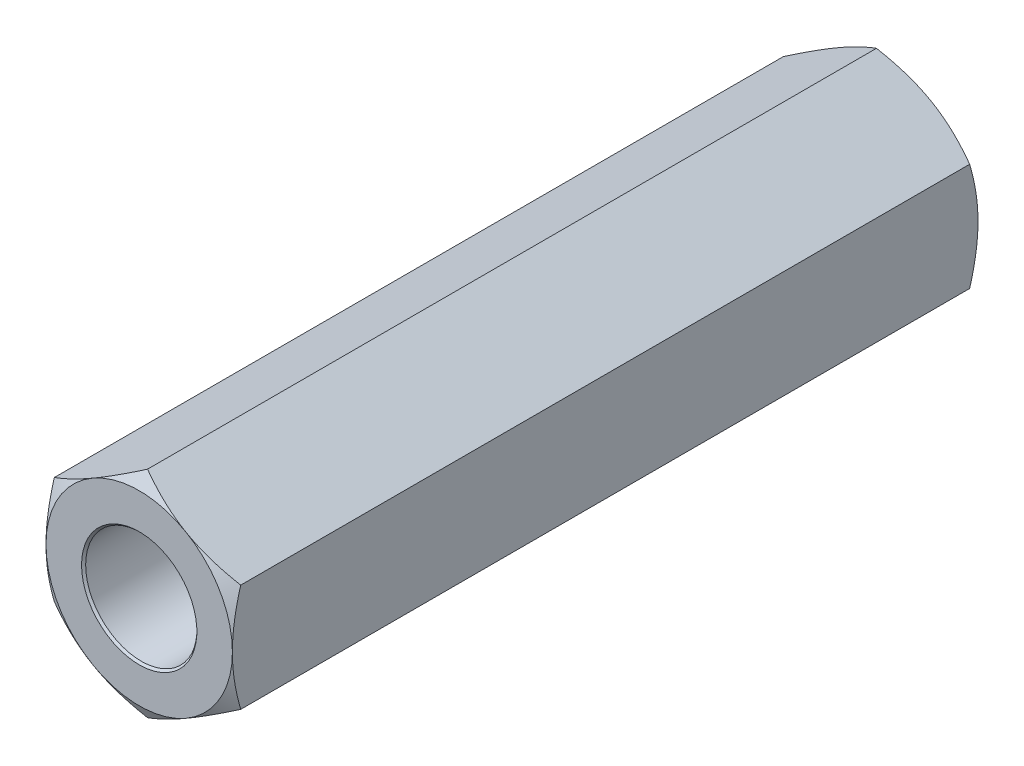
ISO-10303-21;
HEADER;
FILE_DESCRIPTION(('STEP AP214'),'2;1');
FILE_NAME('part.step','',(''),(''),'','','');
FILE_SCHEMA(('AUTOMOTIVE_DESIGN { 1 0 10303 214 1 1 1 1 }'));
ENDSEC;
DATA;
#1=APPLICATION_CONTEXT('core data for automotive mechanical design processes');
#2=APPLICATION_PROTOCOL_DEFINITION('international standard','automotive_design',2000,#1);
#3=PRODUCT_CONTEXT('',#1,'mechanical');
#4=PRODUCT('Part','Part','',(#3));
#5=PRODUCT_RELATED_PRODUCT_CATEGORY('part','',(#4));
#6=PRODUCT_DEFINITION_FORMATION('','',#4);
#7=PRODUCT_DEFINITION_CONTEXT('part definition',#1,'design');
#8=PRODUCT_DEFINITION('design','',#6,#7);
#9=PRODUCT_DEFINITION_SHAPE('','',#8);
#10=(LENGTH_UNIT() NAMED_UNIT(*) SI_UNIT(.MILLI.,.METRE.));
#11=(NAMED_UNIT(*) PLANE_ANGLE_UNIT() SI_UNIT($,.RADIAN.));
#12=(NAMED_UNIT(*) SI_UNIT($,.STERADIAN.) SOLID_ANGLE_UNIT());
#13=UNCERTAINTY_MEASURE_WITH_UNIT(LENGTH_MEASURE(1.E-05),#10,'distance_accuracy_value','');
#14=(GEOMETRIC_REPRESENTATION_CONTEXT(3) GLOBAL_UNCERTAINTY_ASSIGNED_CONTEXT((#13)) GLOBAL_UNIT_ASSIGNED_CONTEXT((#10,
#11,#12)) REPRESENTATION_CONTEXT('',''));
#15=CARTESIAN_POINT('',(0.,0.,0.));
#16=DIRECTION('',(0.,0.,1.));
#17=DIRECTION('',(1.,0.,0.));
#18=AXIS2_PLACEMENT_3D('',#15,#16,#17);
#19=CARTESIAN_POINT('',(0.,2.74963065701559,9.525));
#20=DIRECTION('',(0.,0.,1.));
#21=DIRECTION('',(1.,0.,0.));
#22=AXIS2_PLACEMENT_3D('',#19,#20,#21);
#23=PLANE('',#22);
#24=CARTESIAN_POINT('',(0.,0.,9.525));
#25=DIRECTION('',(0.,0.,-1.));
#26=DIRECTION('',(-1.,0.,0.));
#27=AXIS2_PLACEMENT_3D('',#24,#25,#26);
#28=CIRCLE('',#27,2.38125);
#29=CARTESIAN_POINT('',(2.38125,0.,9.525));
#30=VERTEX_POINT('',#29);
#31=CARTESIAN_POINT('',(1.190625,-2.06222299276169,9.525));
#32=VERTEX_POINT('',#31);
#33=EDGE_CURVE('E145',#30,#32,#28,.T.);
#34=ORIENTED_EDGE('',*,*,#33,.F.);
#35=CARTESIAN_POINT('',(1.190625,2.0622229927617,9.525));
#36=VERTEX_POINT('',#35);
#37=EDGE_CURVE('E135',#36,#30,#28,.T.);
#38=ORIENTED_EDGE('',*,*,#37,.F.);
#39=CARTESIAN_POINT('',(-1.190625,2.0622229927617,9.525));
#40=VERTEX_POINT('',#39);
#41=EDGE_CURVE('E144',#40,#36,#28,.T.);
#42=ORIENTED_EDGE('',*,*,#41,.F.);
#43=CARTESIAN_POINT('',(-2.38125,0.,9.525));
#44=VERTEX_POINT('',#43);
#45=EDGE_CURVE('E60',#44,#40,#28,.T.);
#46=ORIENTED_EDGE('',*,*,#45,.F.);
#47=CARTESIAN_POINT('',(-1.190625,-2.0622229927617,9.525));
#48=VERTEX_POINT('',#47);
#49=EDGE_CURVE('E68',#48,#44,#28,.T.);
#50=ORIENTED_EDGE('',*,*,#49,.F.);
#51=EDGE_CURVE('E162',#32,#48,#28,.T.);
#52=ORIENTED_EDGE('',*,*,#51,.F.);
#53=EDGE_LOOP('',(#34,#38,#42,#46,#50,#52));
#54=FACE_BOUND('',#53,.T.);
#55=CARTESIAN_POINT('',(0.,0.,9.525));
#56=DIRECTION('',(0.,0.,-1.));
#57=DIRECTION('',(-1.,0.,0.));
#58=AXIS2_PLACEMENT_3D('',#55,#56,#57);
#59=CIRCLE('',#58,1.4732);
#60=CARTESIAN_POINT('',(-1.4732,0.,9.525));
#61=VERTEX_POINT('',#60);
#62=EDGE_CURVE('E331',#61,#61,#59,.T.);
#63=ORIENTED_EDGE('',*,*,#62,.T.);
#64=EDGE_LOOP('',(#63));
#65=FACE_BOUND('',#64,.T.);
#66=ADVANCED_FACE('F38',(#54,#65),#23,.T.);
#67=CARTESIAN_POINT('',(0.,0.,9.525));
#68=DIRECTION('',(0.,0.,-1.));
#69=DIRECTION('',(-1.,0.,0.));
#70=AXIS2_PLACEMENT_3D('',#67,#68,#69);
#71=CYLINDRICAL_SURFACE('',#70,1.4224);
#72=CARTESIAN_POINT('',(0.,0.,-9.47052366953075));
#73=DIRECTION('',(0.,0.,-1.));
#74=DIRECTION('',(-1.,0.,0.));
#75=AXIS2_PLACEMENT_3D('',#72,#73,#74);
#76=CIRCLE('',#75,1.4224);
#77=CARTESIAN_POINT('',(-1.4224,0.,-9.47052366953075));
#78=VERTEX_POINT('',#77);
#79=EDGE_CURVE('E314',#78,#78,#76,.F.);
#80=CARTESIAN_POINT('',(0.,0.,9.47052366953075));
#81=DIRECTION('',(0.,0.,1.));
#82=DIRECTION('',(1.,0.,0.));
#83=AXIS2_PLACEMENT_3D('',#80,#81,#82);
#84=CIRCLE('',#83,1.4224);
#85=CARTESIAN_POINT('',(-1.4224,0.,9.47052366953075));
#86=VERTEX_POINT('',#85);
#87=EDGE_CURVE('E329',#86,#86,#84,.T.);
#88=CARTESIAN_POINT('',(-1.4224,0.,-9.47052366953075));
#89=CARTESIAN_POINT('',(-1.4224,0.,-9.27322109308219));
#90=CARTESIAN_POINT('',(-1.4224,0.,-9.07591851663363));
#91=CARTESIAN_POINT('',(-1.4224,0.,-8.68131336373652));
#92=CARTESIAN_POINT('',(-1.4224,0.,-8.48401078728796));
#93=CARTESIAN_POINT('',(-1.4224,0.,-8.08940563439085));
#94=CARTESIAN_POINT('',(-1.4224,0.,-7.89210305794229));
#95=CARTESIAN_POINT('',(-1.4224,0.,-7.49749790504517));
#96=CARTESIAN_POINT('',(-1.4224,0.,-7.30019532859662));
#97=CARTESIAN_POINT('',(-1.4224,0.,-6.9055901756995));
#98=CARTESIAN_POINT('',(-1.4224,0.,-6.70828759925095));
#99=CARTESIAN_POINT('',(-1.4224,0.,-6.31368244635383));
#100=CARTESIAN_POINT('',(-1.4224,0.,-6.11637986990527));
#101=CARTESIAN_POINT('',(-1.4224,0.,-5.72177471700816));
#102=CARTESIAN_POINT('',(-1.4224,0.,-5.5244721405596));
#103=CARTESIAN_POINT('',(-1.4224,0.,-5.12986698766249));
#104=CARTESIAN_POINT('',(-1.4224,0.,-4.93256441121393));
#105=CARTESIAN_POINT('',(-1.4224,0.,-4.53795925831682));
#106=CARTESIAN_POINT('',(-1.4224,0.,-4.34065668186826));
#107=CARTESIAN_POINT('',(-1.4224,0.,-3.94605152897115));
#108=CARTESIAN_POINT('',(-1.4224,0.,-3.74874895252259));
#109=CARTESIAN_POINT('',(-1.4224,0.,-3.35414379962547));
#110=CARTESIAN_POINT('',(-1.4224,0.,-3.15684122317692));
#111=CARTESIAN_POINT('',(-1.4224,0.,-2.7622360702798));
#112=CARTESIAN_POINT('',(-1.4224,0.,-2.56493349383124));
#113=CARTESIAN_POINT('',(-1.4224,0.,-2.17032834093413));
#114=CARTESIAN_POINT('',(-1.4224,0.,-1.97302576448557));
#115=CARTESIAN_POINT('',(-1.4224,0.,-1.57842061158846));
#116=CARTESIAN_POINT('',(-1.4224,0.,-1.3811180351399));
#117=CARTESIAN_POINT('',(-1.4224,0.,-0.986512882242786));
#118=CARTESIAN_POINT('',(-1.4224,0.,-0.789210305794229));
#119=CARTESIAN_POINT('',(-1.4224,0.,-0.394605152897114));
#120=CARTESIAN_POINT('',(-1.4224,0.,-0.197302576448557));
#121=CARTESIAN_POINT('',(-1.4224,0.,0.197302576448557));
#122=CARTESIAN_POINT('',(-1.4224,0.,0.394605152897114));
#123=CARTESIAN_POINT('',(-1.4224,0.,0.789210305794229));
#124=CARTESIAN_POINT('',(-1.4224,0.,0.986512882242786));
#125=CARTESIAN_POINT('',(-1.4224,0.,1.3811180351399));
#126=CARTESIAN_POINT('',(-1.4224,0.,1.57842061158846));
#127=CARTESIAN_POINT('',(-1.4224,0.,1.97302576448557));
#128=CARTESIAN_POINT('',(-1.4224,0.,2.17032834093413));
#129=CARTESIAN_POINT('',(-1.4224,0.,2.56493349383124));
#130=CARTESIAN_POINT('',(-1.4224,0.,2.7622360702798));
#131=CARTESIAN_POINT('',(-1.4224,0.,3.15684122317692));
#132=CARTESIAN_POINT('',(-1.4224,0.,3.35414379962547));
#133=CARTESIAN_POINT('',(-1.4224,0.,3.74874895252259));
#134=CARTESIAN_POINT('',(-1.4224,0.,3.94605152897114));
#135=CARTESIAN_POINT('',(-1.4224,0.,4.34065668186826));
#136=CARTESIAN_POINT('',(-1.4224,0.,4.53795925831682));
#137=CARTESIAN_POINT('',(-1.4224,0.,4.93256441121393));
#138=CARTESIAN_POINT('',(-1.4224,0.,5.12986698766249));
#139=CARTESIAN_POINT('',(-1.4224,0.,5.5244721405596));
#140=CARTESIAN_POINT('',(-1.4224,0.,5.72177471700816));
#141=CARTESIAN_POINT('',(-1.4224,0.,6.11637986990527));
#142=CARTESIAN_POINT('',(-1.4224,0.,6.31368244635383));
#143=CARTESIAN_POINT('',(-1.4224,0.,6.70828759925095));
#144=CARTESIAN_POINT('',(-1.4224,0.,6.9055901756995));
#145=CARTESIAN_POINT('',(-1.4224,0.,7.30019532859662));
#146=CARTESIAN_POINT('',(-1.4224,0.,7.49749790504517));
#147=CARTESIAN_POINT('',(-1.4224,0.,7.89210305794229));
#148=CARTESIAN_POINT('',(-1.4224,0.,8.08940563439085));
#149=CARTESIAN_POINT('',(-1.4224,0.,8.48401078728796));
#150=CARTESIAN_POINT('',(-1.4224,0.,8.68131336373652));
#151=CARTESIAN_POINT('',(-1.4224,0.,9.07591851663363));
#152=CARTESIAN_POINT('',(-1.4224,0.,9.27322109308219));
#153=CARTESIAN_POINT('',(-1.4224,0.,9.47052366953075));
#154=B_SPLINE_CURVE_WITH_KNOTS('',3,(#88,#89,#90,#91,#92,#93,#94,#95,#96,#97,#98,#99,#100,#101,
#102,#103,#104,#105,#106,#107,#108,#109,#110,#111,#112,#113,#114,#115,#116,#117,#118,#119,#120,
#121,#122,#123,#124,#125,#126,#127,#128,#129,#130,#131,#132,#133,#134,#135,#136,#137,#138,#139,
#140,#141,#142,#143,#144,#145,#146,#147,#148,#149,#150,#151,#152,#153),.UNSPECIFIED.,.F.,.F.,(4,
2,2,2,2,2,2,2,2,2,2,2,2,2,2,2,2,2,2,2,2,2,2,2,2,2,2,2,2,2,2,2,4),(0.,0.591907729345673,
1.18381545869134,1.77572318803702,2.36763091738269,2.95953864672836,3.55144637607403,
4.1433541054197,4.73526183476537,5.32716956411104,5.91907729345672,6.51098502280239,
7.10289275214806,7.69480048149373,8.2867082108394,8.87861594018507,9.47052366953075,
10.0624313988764,10.6543391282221,11.2462468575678,11.8381545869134,12.4300623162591,
13.0219700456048,13.6138777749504,14.2057855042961,14.7976932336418,15.3896009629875,
15.9815086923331,16.5734164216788,17.1653241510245,17.7572318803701,18.3491396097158,
18.9410473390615),.UNSPECIFIED.);
#155=EDGE_CURVE('BSEAM369',#78,#86,#154,.T.);
#156=ORIENTED_EDGE('',*,*,#79,.F.);
#157=ORIENTED_EDGE('',*,*,#87,.T.);
#158=ORIENTED_EDGE('',*,*,#155,.T.);
#159=ORIENTED_EDGE('',*,*,#155,.F.);
#160=EDGE_LOOP('',(#156,#158,#157,#159));
#161=FACE_BOUND('',#160,.T.);
#162=ADVANCED_FACE('F369',(#161),#71,.F.);
#163=CARTESIAN_POINT('',(2.38125,1.3748153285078,9.525));
#164=DIRECTION('',(-0.499999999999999,-0.866025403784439,0.));
#165=DIRECTION('',(0.866025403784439,-0.499999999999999,0.));
#166=AXIS2_PLACEMENT_3D('',#163,#164,#165);
#167=PLANE('',#166);
#168=DIRECTION('',(0.,0.,-1.));
#169=VECTOR('',#168,1.);
#170=CARTESIAN_POINT('',(0.,2.74963065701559,9.525));
#171=LINE('',#170,#169);
#172=CARTESIAN_POINT('',(0.,2.74963065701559,9.3123153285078));
#173=VERTEX_POINT('',#172);
#174=CARTESIAN_POINT('',(0.,2.74963065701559,-9.3123153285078));
#175=VERTEX_POINT('',#174);
#176=EDGE_CURVE('E327',#173,#175,#171,.T.);
#177=ORIENTED_EDGE('',*,*,#176,.F.);
#178=CARTESIAN_POINT('',(-0.000200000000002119,2.74974612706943,9.31224865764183));
#179=CARTESIAN_POINT('',(0.104444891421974,2.68932937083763,9.34714474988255));
#180=CARTESIAN_POINT('',(0.209993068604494,2.62839110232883,9.37888175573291));
#181=CARTESIAN_POINT('',(0.422917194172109,2.5054593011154,9.43427966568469));
#182=CARTESIAN_POINT('',(0.530296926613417,2.4434635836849,9.45792097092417));
#183=CARTESIAN_POINT('',(0.743725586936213,2.32024048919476,9.49472299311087));
#184=CARTESIAN_POINT('',(0.849741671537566,2.25903207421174,9.50812863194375));
#185=CARTESIAN_POINT('',(1.06227281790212,2.13632715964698,9.52413371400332));
#186=CARTESIAN_POINT('',(1.16878710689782,2.07483110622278,9.52674640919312));
#187=CARTESIAN_POINT('',(1.36782399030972,1.95991710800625,9.52131824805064));
#188=CARTESIAN_POINT('',(1.46037634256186,1.90648198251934,9.51461019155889));
#189=CARTESIAN_POINT('',(1.64487805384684,1.79995986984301,9.49334736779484));
#190=CARTESIAN_POINT('',(1.73682677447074,1.74687325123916,9.47878533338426));
#191=CARTESIAN_POINT('',(1.92170905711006,1.64013141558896,9.44238049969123));
#192=CARTESIAN_POINT('',(2.01461921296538,1.58648971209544,9.42038334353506));
#193=CARTESIAN_POINT('',(2.19905359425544,1.4800064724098,9.37045811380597));
#194=CARTESIAN_POINT('',(2.2905801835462,1.42716357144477,9.34254177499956));
#195=CARTESIAN_POINT('',(2.38145,1.37469985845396,9.31224865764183));
#196=B_SPLINE_CURVE_WITH_KNOTS('',3,(#178,#179,#180,#181,#182,#183,#184,#185,#186,#187,#188,
#189,#190,#191,#192,#193,#194,#195),.UNSPECIFIED.,.F.,.F.,(4,2,2,2,2,2,2,2,4),(0.,
0.377463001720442,0.755833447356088,1.12483885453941,1.49339104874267,1.81432726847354,
2.1355609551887,2.46392121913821,2.79163649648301),.UNSPECIFIED.);
#197=EDGE_CURVE('E349',#173,#36,#196,.T.);
#198=ORIENTED_EDGE('',*,*,#197,.T.);
#199=CARTESIAN_POINT('',(2.38125,1.3748153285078,9.3123153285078));
#200=VERTEX_POINT('',#199);
#201=EDGE_CURVE('E139',#36,#200,#196,.T.);
#202=ORIENTED_EDGE('',*,*,#201,.T.);
#203=DIRECTION('',(0.,0.,-1.));
#204=VECTOR('',#203,1.);
#205=CARTESIAN_POINT('',(2.38125,1.3748153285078,9.525));
#206=LINE('',#205,#204);
#207=CARTESIAN_POINT('',(2.38125,1.3748153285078,-9.3123153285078));
#208=VERTEX_POINT('',#207);
#209=EDGE_CURVE('E159',#200,#208,#206,.T.);
#210=ORIENTED_EDGE('',*,*,#209,.T.);
#211=CARTESIAN_POINT('',(-0.000200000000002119,2.74974612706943,-9.31224865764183));
#212=CARTESIAN_POINT('',(0.104444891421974,2.68932937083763,-9.34714474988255));
#213=CARTESIAN_POINT('',(0.209993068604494,2.62839110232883,-9.37888175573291));
#214=CARTESIAN_POINT('',(0.422917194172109,2.5054593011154,-9.43427966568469));
#215=CARTESIAN_POINT('',(0.530296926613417,2.4434635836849,-9.45792097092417));
#216=CARTESIAN_POINT('',(0.743725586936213,2.32024048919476,-9.49472299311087));
#217=CARTESIAN_POINT('',(0.849741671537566,2.25903207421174,-9.50812863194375));
#218=CARTESIAN_POINT('',(1.06227281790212,2.13632715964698,-9.52413371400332));
#219=CARTESIAN_POINT('',(1.16878710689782,2.07483110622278,-9.52674640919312));
#220=CARTESIAN_POINT('',(1.36782399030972,1.95991710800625,-9.52131824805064));
#221=CARTESIAN_POINT('',(1.46037634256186,1.90648198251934,-9.51461019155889));
#222=CARTESIAN_POINT('',(1.64487805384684,1.79995986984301,-9.49334736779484));
#223=CARTESIAN_POINT('',(1.73682677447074,1.74687325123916,-9.47878533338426));
#224=CARTESIAN_POINT('',(1.92170905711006,1.64013141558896,-9.44238049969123));
#225=CARTESIAN_POINT('',(2.01461921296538,1.58648971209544,-9.42038334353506));
#226=CARTESIAN_POINT('',(2.19905359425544,1.4800064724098,-9.37045811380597));
#227=CARTESIAN_POINT('',(2.2905801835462,1.42716357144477,-9.34254177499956));
#228=CARTESIAN_POINT('',(2.38145,1.37469985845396,-9.31224865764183));
#229=B_SPLINE_CURVE_WITH_KNOTS('',3,(#211,#212,#213,#214,#215,#216,#217,#218,#219,#220,#221,
#222,#223,#224,#225,#226,#227,#228),.UNSPECIFIED.,.F.,.F.,(4,2,2,2,2,2,2,2,4),(0.,
0.377463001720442,0.755833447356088,1.12483885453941,1.49339104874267,1.81432726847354,
2.1355609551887,2.46392121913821,2.79163649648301),.UNSPECIFIED.);
#230=CARTESIAN_POINT('',(1.190625,2.0622229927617,-9.525));
#231=VERTEX_POINT('',#230);
#232=EDGE_CURVE('E231',#231,#208,#229,.T.);
#233=ORIENTED_EDGE('',*,*,#232,.F.);
#234=EDGE_CURVE('E283',#175,#231,#229,.T.);
#235=ORIENTED_EDGE('',*,*,#234,.F.);
#236=EDGE_LOOP('',(#177,#198,#202,#210,#233,#235));
#237=FACE_BOUND('',#236,.T.);
#238=ADVANCED_FACE('F40',(#237),#167,.F.);
#239=CARTESIAN_POINT('',(0.,2.74963065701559,9.525));
#240=DIRECTION('',(0.500000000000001,-0.866025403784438,0.));
#241=DIRECTION('',(0.866025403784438,0.500000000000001,0.));
#242=AXIS2_PLACEMENT_3D('',#239,#240,#241);
#243=PLANE('',#242);
#244=DIRECTION('',(0.,0.,-1.));
#245=VECTOR('',#244,1.);
#246=CARTESIAN_POINT('',(-2.38125,1.3748153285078,9.525));
#247=LINE('',#246,#245);
#248=CARTESIAN_POINT('',(-2.38125,1.3748153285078,9.3123153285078));
#249=VERTEX_POINT('',#248);
#250=CARTESIAN_POINT('',(-2.38125,1.3748153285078,-9.3123153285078));
#251=VERTEX_POINT('',#250);
#252=EDGE_CURVE('E325',#249,#251,#247,.T.);
#253=ORIENTED_EDGE('',*,*,#252,.F.);
#254=CARTESIAN_POINT('',(-2.38145,1.37469985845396,9.31224865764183));
#255=CARTESIAN_POINT('',(-2.27680510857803,1.43511661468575,9.34714474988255));
#256=CARTESIAN_POINT('',(-2.17125693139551,1.49605488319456,9.37888175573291));
#257=CARTESIAN_POINT('',(-1.95833280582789,1.61898668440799,9.43427966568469));
#258=CARTESIAN_POINT('',(-1.85095307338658,1.68098240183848,9.45792097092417));
#259=CARTESIAN_POINT('',(-1.63752441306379,1.80420549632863,9.49472299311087));
#260=CARTESIAN_POINT('',(-1.53150832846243,1.86541391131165,9.50812863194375));
#261=CARTESIAN_POINT('',(-1.31897718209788,1.98811882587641,9.52413371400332));
#262=CARTESIAN_POINT('',(-1.21246289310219,2.04961487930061,9.52674640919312));
#263=CARTESIAN_POINT('',(-1.01342600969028,2.16452887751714,9.52131824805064));
#264=CARTESIAN_POINT('',(-0.920873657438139,2.21796400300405,9.51461019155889));
#265=CARTESIAN_POINT('',(-0.736371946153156,2.32448611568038,9.49334736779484));
#266=CARTESIAN_POINT('',(-0.644423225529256,2.37757273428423,9.47878533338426));
#267=CARTESIAN_POINT('',(-0.459540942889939,2.48431456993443,9.44238049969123));
#268=CARTESIAN_POINT('',(-0.366630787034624,2.53795627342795,9.42038334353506));
#269=CARTESIAN_POINT('',(-0.182196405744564,2.64443951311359,9.37045811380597));
#270=CARTESIAN_POINT('',(-0.0906698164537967,2.69728241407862,9.34254177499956));
#271=CARTESIAN_POINT('',(0.000199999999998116,2.74974612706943,9.31224865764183));
#272=B_SPLINE_CURVE_WITH_KNOTS('',3,(#254,#255,#256,#257,#258,#259,#260,#261,#262,#263,#264,
#265,#266,#267,#268,#269,#270,#271),.UNSPECIFIED.,.F.,.F.,(4,2,2,2,2,2,2,2,4),(0.,
0.377463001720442,0.755833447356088,1.12483885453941,1.49339104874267,1.81432726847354,
2.1355609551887,2.46392121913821,2.79163649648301),.UNSPECIFIED.);
#273=EDGE_CURVE('E343',#249,#40,#272,.T.);
#274=ORIENTED_EDGE('',*,*,#273,.T.);
#275=EDGE_CURVE('E207',#40,#173,#272,.T.);
#276=ORIENTED_EDGE('',*,*,#275,.T.);
#277=ORIENTED_EDGE('',*,*,#176,.T.);
#278=CARTESIAN_POINT('',(-2.38145,1.37469985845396,-9.31224865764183));
#279=CARTESIAN_POINT('',(-2.27680510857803,1.43511661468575,-9.34714474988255));
#280=CARTESIAN_POINT('',(-2.17125693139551,1.49605488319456,-9.37888175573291));
#281=CARTESIAN_POINT('',(-1.95833280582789,1.61898668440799,-9.43427966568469));
#282=CARTESIAN_POINT('',(-1.85095307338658,1.68098240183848,-9.45792097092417));
#283=CARTESIAN_POINT('',(-1.63752441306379,1.80420549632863,-9.49472299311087));
#284=CARTESIAN_POINT('',(-1.53150832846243,1.86541391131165,-9.50812863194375));
#285=CARTESIAN_POINT('',(-1.31897718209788,1.98811882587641,-9.52413371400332));
#286=CARTESIAN_POINT('',(-1.21246289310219,2.04961487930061,-9.52674640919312));
#287=CARTESIAN_POINT('',(-1.01342600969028,2.16452887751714,-9.52131824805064));
#288=CARTESIAN_POINT('',(-0.920873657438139,2.21796400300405,-9.51461019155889));
#289=CARTESIAN_POINT('',(-0.736371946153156,2.32448611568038,-9.49334736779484));
#290=CARTESIAN_POINT('',(-0.644423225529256,2.37757273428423,-9.47878533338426));
#291=CARTESIAN_POINT('',(-0.459540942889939,2.48431456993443,-9.44238049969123));
#292=CARTESIAN_POINT('',(-0.366630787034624,2.53795627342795,-9.42038334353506));
#293=CARTESIAN_POINT('',(-0.182196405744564,2.64443951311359,-9.37045811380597));
#294=CARTESIAN_POINT('',(-0.0906698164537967,2.69728241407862,-9.34254177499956));
#295=CARTESIAN_POINT('',(0.000199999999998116,2.74974612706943,-9.31224865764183));
#296=B_SPLINE_CURVE_WITH_KNOTS('',3,(#278,#279,#280,#281,#282,#283,#284,#285,#286,#287,#288,
#289,#290,#291,#292,#293,#294,#295),.UNSPECIFIED.,.F.,.F.,(4,2,2,2,2,2,2,2,4),(0.,
0.377463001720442,0.755833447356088,1.12483885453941,1.49339104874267,1.81432726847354,
2.1355609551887,2.46392121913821,2.79163649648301),.UNSPECIFIED.);
#297=CARTESIAN_POINT('',(-1.190625,2.06222299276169,-9.525));
#298=VERTEX_POINT('',#297);
#299=EDGE_CURVE('E228',#298,#175,#296,.T.);
#300=ORIENTED_EDGE('',*,*,#299,.F.);
#301=EDGE_CURVE('E547',#251,#298,#296,.T.);
#302=ORIENTED_EDGE('',*,*,#301,.F.);
#303=EDGE_LOOP('',(#253,#274,#276,#277,#300,#302));
#304=FACE_BOUND('',#303,.T.);
#305=ADVANCED_FACE('F347',(#304),#243,.F.);
#306=CARTESIAN_POINT('',(-2.38125,1.3748153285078,9.525));
#307=DIRECTION('',(1.,0.,0.));
#308=DIRECTION('',(0.,1.,0.));
#309=AXIS2_PLACEMENT_3D('',#306,#307,#308);
#310=PLANE('',#309);
#311=DIRECTION('',(0.,0.,-1.));
#312=VECTOR('',#311,1.);
#313=CARTESIAN_POINT('',(-2.38125,-1.3748153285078,9.525));
#314=LINE('',#313,#312);
#315=CARTESIAN_POINT('',(-2.38125,-1.3748153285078,9.3123153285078));
#316=VERTEX_POINT('',#315);
#317=CARTESIAN_POINT('',(-2.38125,-1.3748153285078,-9.3123153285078));
#318=VERTEX_POINT('',#317);
#319=EDGE_CURVE('E323',#316,#318,#314,.T.);
#320=ORIENTED_EDGE('',*,*,#319,.F.);
#321=CARTESIAN_POINT('',(-2.38125,-13.6035792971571,2.92636519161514));
#322=CARTESIAN_POINT('',(-2.38125,-13.1804725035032,3.16696813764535));
#323=CARTESIAN_POINT('',(-2.38125,-12.757237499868,3.40734653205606));
#324=CARTESIAN_POINT('',(-2.38125,-11.9099125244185,3.88769064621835));
#325=CARTESIAN_POINT('',(-2.38125,-11.4858221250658,4.12765561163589));
#326=CARTESIAN_POINT('',(-2.38125,-10.6277430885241,4.61197031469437));
#327=CARTESIAN_POINT('',(-2.38125,-10.1937429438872,4.85629967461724));
#328=CARTESIAN_POINT('',(-2.38125,-9.32545882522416,5.34332172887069));
#329=CARTESIAN_POINT('',(-2.38125,-8.8911757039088,5.58601594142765));
#330=CARTESIAN_POINT('',(-2.38125,-8.15578366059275,5.99469661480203));
#331=CARTESIAN_POINT('',(-2.38125,-7.85497412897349,6.16122152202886));
#332=CARTESIAN_POINT('',(-2.38125,-7.2526064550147,6.49291120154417));
#333=CARTESIAN_POINT('',(-2.38125,-6.95104831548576,6.65807597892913));
#334=CARTESIAN_POINT('',(-2.38125,-6.34568528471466,6.98711763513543));
#335=CARTESIAN_POINT('',(-2.38125,-6.04187622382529,7.15098685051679));
#336=CARTESIAN_POINT('',(-2.38125,-5.432819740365,7.47577701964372));
#337=CARTESIAN_POINT('',(-2.38125,-5.12757287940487,7.63669902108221));
#338=CARTESIAN_POINT('',(-2.38125,-4.67051906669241,7.87328145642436));
#339=CARTESIAN_POINT('',(-2.38125,-4.51961643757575,7.95068735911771));
#340=CARTESIAN_POINT('',(-2.38125,-4.21707946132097,8.10405393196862));
#341=CARTESIAN_POINT('',(-2.38125,-4.0654451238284,8.18001462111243));
#342=CARTESIAN_POINT('',(-2.38125,-3.76101516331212,8.33016468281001));
#343=CARTESIAN_POINT('',(-2.38125,-3.6082181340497,8.40435121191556));
#344=CARTESIAN_POINT('',(-2.38125,-3.30142649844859,8.5501927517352));
#345=CARTESIAN_POINT('',(-2.38125,-3.14743196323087,8.62184791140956));
#346=CARTESIAN_POINT('',(-2.38125,-2.83900288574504,8.76119250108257));
#347=CARTESIAN_POINT('',(-2.38125,-2.68457975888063,8.82890705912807));
#348=CARTESIAN_POINT('',(-2.38125,-2.37366659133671,8.95960312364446));
#349=CARTESIAN_POINT('',(-2.38125,-2.21717593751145,9.02258318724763));
#350=CARTESIAN_POINT('',(-2.38125,-1.90202586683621,9.1416094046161));
#351=CARTESIAN_POINT('',(-2.38125,-1.74337328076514,9.1976734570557));
#352=CARTESIAN_POINT('',(-2.38125,-1.42299136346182,9.30007535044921));
#353=CARTESIAN_POINT('',(-2.38125,-1.26126468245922,9.34642118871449));
#354=CARTESIAN_POINT('',(-2.38125,-1.03947161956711,9.40003222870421));
#355=CARTESIAN_POINT('',(-2.38125,-0.980839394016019,9.41327698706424));
#356=CARTESIAN_POINT('',(-2.38125,-0.863143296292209,9.43781287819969));
#357=CARTESIAN_POINT('',(-2.38125,-0.804079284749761,9.44910334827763));
#358=CARTESIAN_POINT('',(-2.38125,-0.68560658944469,9.469522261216));
#359=CARTESIAN_POINT('',(-2.38125,-0.626198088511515,9.47865175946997));
#360=CARTESIAN_POINT('',(-2.38125,-0.507069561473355,9.49457353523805));
#361=CARTESIAN_POINT('',(-2.38125,-0.447349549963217,9.50136592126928));
#362=CARTESIAN_POINT('',(-2.38125,-0.328989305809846,9.51234140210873));
#363=CARTESIAN_POINT('',(-2.38125,-0.270354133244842,9.51657848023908));
#364=CARTESIAN_POINT('',(-2.38125,-0.152962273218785,9.52258101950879));
#365=CARTESIAN_POINT('',(-2.38125,-0.0942055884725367,9.52434653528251));
#366=CARTESIAN_POINT('',(-2.38125,0.0821640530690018,9.52585079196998));
#367=CARTESIAN_POINT('',(-2.38125,0.199835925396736,9.52179339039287));
#368=CARTESIAN_POINT('',(-2.38125,0.398457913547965,9.50666837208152));
#369=CARTESIAN_POINT('',(-2.38125,0.479617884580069,9.49812813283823));
#370=CARTESIAN_POINT('',(-2.38125,0.641372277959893,9.47672966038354));
#371=CARTESIAN_POINT('',(-2.38125,0.721966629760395,9.46387089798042));
#372=CARTESIAN_POINT('',(-2.38125,0.962716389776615,9.41949683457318));
#373=CARTESIAN_POINT('',(-2.38125,1.12181620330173,9.38218568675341));
#374=CARTESIAN_POINT('',(-2.38125,1.36019195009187,9.31705572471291));
#375=CARTESIAN_POINT('',(-2.38125,1.44068473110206,9.29343595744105));
#376=CARTESIAN_POINT('',(-2.38125,1.60088701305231,9.24365147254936));
#377=CARTESIAN_POINT('',(-2.38125,1.68059650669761,9.21748673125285));
#378=CARTESIAN_POINT('',(-2.38125,1.83927176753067,9.16303688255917));
#379=CARTESIAN_POINT('',(-2.38125,1.91823761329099,9.13475200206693));
#380=CARTESIAN_POINT('',(-2.38125,2.07550454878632,9.07640717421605));
#381=CARTESIAN_POINT('',(-2.38125,2.15380566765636,9.04634730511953));
#382=CARTESIAN_POINT('',(-2.38125,2.41551397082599,8.94303274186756));
#383=CARTESIAN_POINT('',(-2.38125,2.59759942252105,8.86643174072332));
#384=CARTESIAN_POINT('',(-2.38125,2.95940552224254,8.70781095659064));
#385=CARTESIAN_POINT('',(-2.38125,3.13912561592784,8.62578992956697));
#386=CARTESIAN_POINT('',(-2.38125,3.49692302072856,8.45796160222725));
#387=CARTESIAN_POINT('',(-2.38125,3.6749992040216,8.3721519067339));
#388=CARTESIAN_POINT('',(-2.38125,4.02985016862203,8.19787997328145));
#389=CARTESIAN_POINT('',(-2.38125,4.20662490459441,8.10941764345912));
#390=CARTESIAN_POINT('',(-2.38125,4.55958922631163,7.93035432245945));
#391=CARTESIAN_POINT('',(-2.38125,4.73577657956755,7.83974894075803));
#392=CARTESIAN_POINT('',(-2.38125,5.08739439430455,7.65707561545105));
#393=CARTESIAN_POINT('',(-2.38125,5.26282484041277,7.56500764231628));
#394=CARTESIAN_POINT('',(-2.38125,5.78809595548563,7.28722177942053));
#395=CARTESIAN_POINT('',(-2.38125,6.13706029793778,7.09984815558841));
#396=CARTESIAN_POINT('',(-2.38125,6.78106195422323,6.75080147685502));
#397=CARTESIAN_POINT('',(-2.38125,7.07630584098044,6.58950773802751));
#398=CARTESIAN_POINT('',(-2.38125,7.66605942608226,6.26550181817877));
#399=CARTESIAN_POINT('',(-2.38125,7.96056903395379,6.1027894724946));
#400=CARTESIAN_POINT('',(-2.38125,8.54777310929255,5.77705008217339));
#401=CARTESIAN_POINT('',(-2.38125,8.84046996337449,5.61402733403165));
#402=CARTESIAN_POINT('',(-2.38125,9.42539712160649,5.28723484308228));
#403=CARTESIAN_POINT('',(-2.38125,9.71762748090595,5.1234651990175));
#404=CARTESIAN_POINT('',(-2.38125,10.0097071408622,4.95942845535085));
#405=B_SPLINE_CURVE_WITH_KNOTS('',3,(#321,#322,#323,#324,#325,#326,#327,#328,#329,#330,#331,
#332,#333,#334,#335,#336,#337,#338,#339,#340,#341,#342,#343,#344,#345,#346,#347,#348,#349,#350,
#351,#352,#353,#354,#355,#356,#357,#358,#359,#360,#361,#362,#363,#364,#365,#366,#367,#368,#369,
#370,#371,#372,#373,#374,#375,#376,#377,#378,#379,#380,#381,#382,#383,#384,#385,#386,#387,#388,
#389,#390,#391,#392,#393,#394,#395,#396,#397,#398,#399,#400,#401,#402,#403,#404),.UNSPECIFIED.,
.F.,.F.,(4,2,2,2,2,2,2,2,2,2,2,2,2,2,2,2,2,2,2,2,2,2,2,2,2,2,2,2,2,2,2,2,2,2,2,2,2,2,2,2,2,4),
(0.,1.46020000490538,2.92202097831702,4.41616695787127,5.90865093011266,6.94012926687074,
7.97160373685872,9.00715223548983,10.0423251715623,10.5511116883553,11.0598915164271,
11.569438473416,12.0789553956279,12.5847534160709,13.0907049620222,13.5953183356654,
14.0995148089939,14.2798167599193,14.4601797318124,14.6404544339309,14.8207207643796,
14.9970316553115,15.1733386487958,15.5260747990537,15.7707870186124,16.0155292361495,
16.5050805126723,16.7567175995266,17.0083570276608,17.2599695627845,17.5115710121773,
18.104039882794,18.6966452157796,19.2896307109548,19.8826367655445,20.476986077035,
21.0713474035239,22.2595849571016,23.268869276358,24.2782723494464,25.2833735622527,
26.2883455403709),.UNSPECIFIED.);
#406=EDGE_CURVE('E335',#316,#44,#405,.T.);
#407=ORIENTED_EDGE('',*,*,#406,.T.);
#408=EDGE_CURVE('E190',#44,#249,#405,.T.);
#409=ORIENTED_EDGE('',*,*,#408,.T.);
#410=ORIENTED_EDGE('',*,*,#252,.T.);
#411=CARTESIAN_POINT('',(-2.38125,-13.6035792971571,-2.92636519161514));
#412=CARTESIAN_POINT('',(-2.38125,-13.1804725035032,-3.16696813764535));
#413=CARTESIAN_POINT('',(-2.38125,-12.757237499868,-3.40734653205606));
#414=CARTESIAN_POINT('',(-2.38125,-11.9099125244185,-3.88769064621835));
#415=CARTESIAN_POINT('',(-2.38125,-11.4858221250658,-4.12765561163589));
#416=CARTESIAN_POINT('',(-2.38125,-10.6277430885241,-4.61197031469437));
#417=CARTESIAN_POINT('',(-2.38125,-10.1937429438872,-4.85629967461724));
#418=CARTESIAN_POINT('',(-2.38125,-9.32545882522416,-5.34332172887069));
#419=CARTESIAN_POINT('',(-2.38125,-8.8911757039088,-5.58601594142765));
#420=CARTESIAN_POINT('',(-2.38125,-8.15578366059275,-5.99469661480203));
#421=CARTESIAN_POINT('',(-2.38125,-7.85497412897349,-6.16122152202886));
#422=CARTESIAN_POINT('',(-2.38125,-7.2526064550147,-6.49291120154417));
#423=CARTESIAN_POINT('',(-2.38125,-6.95104831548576,-6.65807597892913));
#424=CARTESIAN_POINT('',(-2.38125,-6.34568528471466,-6.98711763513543));
#425=CARTESIAN_POINT('',(-2.38125,-6.04187622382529,-7.15098685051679));
#426=CARTESIAN_POINT('',(-2.38125,-5.432819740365,-7.47577701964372));
#427=CARTESIAN_POINT('',(-2.38125,-5.12757287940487,-7.63669902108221));
#428=CARTESIAN_POINT('',(-2.38125,-4.67051906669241,-7.87328145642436));
#429=CARTESIAN_POINT('',(-2.38125,-4.51961643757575,-7.95068735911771));
#430=CARTESIAN_POINT('',(-2.38125,-4.21707946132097,-8.10405393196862));
#431=CARTESIAN_POINT('',(-2.38125,-4.0654451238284,-8.18001462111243));
#432=CARTESIAN_POINT('',(-2.38125,-3.76101516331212,-8.33016468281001));
#433=CARTESIAN_POINT('',(-2.38125,-3.6082181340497,-8.40435121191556));
#434=CARTESIAN_POINT('',(-2.38125,-3.30142649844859,-8.5501927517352));
#435=CARTESIAN_POINT('',(-2.38125,-3.14743196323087,-8.62184791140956));
#436=CARTESIAN_POINT('',(-2.38125,-2.83900288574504,-8.76119250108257));
#437=CARTESIAN_POINT('',(-2.38125,-2.68457975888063,-8.82890705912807));
#438=CARTESIAN_POINT('',(-2.38125,-2.37366659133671,-8.95960312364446));
#439=CARTESIAN_POINT('',(-2.38125,-2.21717593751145,-9.02258318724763));
#440=CARTESIAN_POINT('',(-2.38125,-1.90202586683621,-9.1416094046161));
#441=CARTESIAN_POINT('',(-2.38125,-1.74337328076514,-9.1976734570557));
#442=CARTESIAN_POINT('',(-2.38125,-1.42299136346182,-9.30007535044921));
#443=CARTESIAN_POINT('',(-2.38125,-1.26126468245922,-9.34642118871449));
#444=CARTESIAN_POINT('',(-2.38125,-1.03947161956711,-9.40003222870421));
#445=CARTESIAN_POINT('',(-2.38125,-0.980839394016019,-9.41327698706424));
#446=CARTESIAN_POINT('',(-2.38125,-0.863143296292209,-9.43781287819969));
#447=CARTESIAN_POINT('',(-2.38125,-0.804079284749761,-9.44910334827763));
#448=CARTESIAN_POINT('',(-2.38125,-0.68560658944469,-9.469522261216));
#449=CARTESIAN_POINT('',(-2.38125,-0.626198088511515,-9.47865175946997));
#450=CARTESIAN_POINT('',(-2.38125,-0.507069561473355,-9.49457353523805));
#451=CARTESIAN_POINT('',(-2.38125,-0.447349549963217,-9.50136592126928));
#452=CARTESIAN_POINT('',(-2.38125,-0.328989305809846,-9.51234140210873));
#453=CARTESIAN_POINT('',(-2.38125,-0.270354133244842,-9.51657848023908));
#454=CARTESIAN_POINT('',(-2.38125,-0.152962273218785,-9.52258101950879));
#455=CARTESIAN_POINT('',(-2.38125,-0.0942055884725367,-9.52434653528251));
#456=CARTESIAN_POINT('',(-2.38125,0.0821640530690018,-9.52585079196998));
#457=CARTESIAN_POINT('',(-2.38125,0.199835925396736,-9.52179339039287));
#458=CARTESIAN_POINT('',(-2.38125,0.398457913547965,-9.50666837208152));
#459=CARTESIAN_POINT('',(-2.38125,0.479617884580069,-9.49812813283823));
#460=CARTESIAN_POINT('',(-2.38125,0.641372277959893,-9.47672966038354));
#461=CARTESIAN_POINT('',(-2.38125,0.721966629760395,-9.46387089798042));
#462=CARTESIAN_POINT('',(-2.38125,0.962716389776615,-9.41949683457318));
#463=CARTESIAN_POINT('',(-2.38125,1.12181620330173,-9.38218568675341));
#464=CARTESIAN_POINT('',(-2.38125,1.36019195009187,-9.31705572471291));
#465=CARTESIAN_POINT('',(-2.38125,1.44068473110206,-9.29343595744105));
#466=CARTESIAN_POINT('',(-2.38125,1.60088701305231,-9.24365147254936));
#467=CARTESIAN_POINT('',(-2.38125,1.68059650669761,-9.21748673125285));
#468=CARTESIAN_POINT('',(-2.38125,1.83927176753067,-9.16303688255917));
#469=CARTESIAN_POINT('',(-2.38125,1.91823761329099,-9.13475200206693));
#470=CARTESIAN_POINT('',(-2.38125,2.07550454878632,-9.07640717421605));
#471=CARTESIAN_POINT('',(-2.38125,2.15380566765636,-9.04634730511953));
#472=CARTESIAN_POINT('',(-2.38125,2.41551397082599,-8.94303274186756));
#473=CARTESIAN_POINT('',(-2.38125,2.59759942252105,-8.86643174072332));
#474=CARTESIAN_POINT('',(-2.38125,2.95940552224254,-8.70781095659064));
#475=CARTESIAN_POINT('',(-2.38125,3.13912561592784,-8.62578992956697));
#476=CARTESIAN_POINT('',(-2.38125,3.49692302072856,-8.45796160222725));
#477=CARTESIAN_POINT('',(-2.38125,3.6749992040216,-8.3721519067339));
#478=CARTESIAN_POINT('',(-2.38125,4.02985016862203,-8.19787997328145));
#479=CARTESIAN_POINT('',(-2.38125,4.20662490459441,-8.10941764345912));
#480=CARTESIAN_POINT('',(-2.38125,4.55958922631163,-7.93035432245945));
#481=CARTESIAN_POINT('',(-2.38125,4.73577657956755,-7.83974894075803));
#482=CARTESIAN_POINT('',(-2.38125,5.08739439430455,-7.65707561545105));
#483=CARTESIAN_POINT('',(-2.38125,5.26282484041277,-7.56500764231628));
#484=CARTESIAN_POINT('',(-2.38125,5.78809595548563,-7.28722177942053));
#485=CARTESIAN_POINT('',(-2.38125,6.13706029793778,-7.09984815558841));
#486=CARTESIAN_POINT('',(-2.38125,6.78106195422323,-6.75080147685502));
#487=CARTESIAN_POINT('',(-2.38125,7.07630584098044,-6.58950773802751));
#488=CARTESIAN_POINT('',(-2.38125,7.66605942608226,-6.26550181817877));
#489=CARTESIAN_POINT('',(-2.38125,7.96056903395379,-6.1027894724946));
#490=CARTESIAN_POINT('',(-2.38125,8.54777310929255,-5.77705008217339));
#491=CARTESIAN_POINT('',(-2.38125,8.84046996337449,-5.61402733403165));
#492=CARTESIAN_POINT('',(-2.38125,9.42539712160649,-5.28723484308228));
#493=CARTESIAN_POINT('',(-2.38125,9.71762748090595,-5.1234651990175));
#494=CARTESIAN_POINT('',(-2.38125,10.0097071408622,-4.95942845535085));
#495=B_SPLINE_CURVE_WITH_KNOTS('',3,(#411,#412,#413,#414,#415,#416,#417,#418,#419,#420,#421,
#422,#423,#424,#425,#426,#427,#428,#429,#430,#431,#432,#433,#434,#435,#436,#437,#438,#439,#440,
#441,#442,#443,#444,#445,#446,#447,#448,#449,#450,#451,#452,#453,#454,#455,#456,#457,#458,#459,
#460,#461,#462,#463,#464,#465,#466,#467,#468,#469,#470,#471,#472,#473,#474,#475,#476,#477,#478,
#479,#480,#481,#482,#483,#484,#485,#486,#487,#488,#489,#490,#491,#492,#493,#494),.UNSPECIFIED.,
.F.,.F.,(4,2,2,2,2,2,2,2,2,2,2,2,2,2,2,2,2,2,2,2,2,2,2,2,2,2,2,2,2,2,2,2,2,2,2,2,2,2,2,2,2,4),
(0.,1.46020000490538,2.92202097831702,4.41616695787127,5.90865093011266,6.94012926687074,
7.97160373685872,9.00715223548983,10.0423251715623,10.5511116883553,11.0598915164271,
11.569438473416,12.0789553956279,12.5847534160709,13.0907049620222,13.5953183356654,
14.0995148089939,14.2798167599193,14.4601797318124,14.6404544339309,14.8207207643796,
14.9970316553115,15.1733386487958,15.5260747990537,15.7707870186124,16.0155292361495,
16.5050805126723,16.7567175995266,17.0083570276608,17.2599695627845,17.5115710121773,
18.104039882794,18.6966452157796,19.2896307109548,19.8826367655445,20.476986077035,
21.0713474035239,22.2595849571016,23.268869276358,24.2782723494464,25.2833735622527,
26.2883455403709),.UNSPECIFIED.);
#496=CARTESIAN_POINT('',(-2.38125,0.,-9.525));
#497=VERTEX_POINT('',#496);
#498=EDGE_CURVE('E254',#497,#251,#495,.T.);
#499=ORIENTED_EDGE('',*,*,#498,.F.);
#500=EDGE_CURVE('E359',#318,#497,#495,.T.);
#501=ORIENTED_EDGE('',*,*,#500,.F.);
#502=EDGE_LOOP('',(#320,#407,#409,#410,#499,#501));
#503=FACE_BOUND('',#502,.T.);
#504=ADVANCED_FACE('F216',(#503),#310,.F.);
#505=CARTESIAN_POINT('',(-2.38125,-1.3748153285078,9.525));
#506=DIRECTION('',(0.5,0.866025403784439,0.));
#507=DIRECTION('',(-0.866025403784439,0.5,0.));
#508=AXIS2_PLACEMENT_3D('',#505,#506,#507);
#509=PLANE('',#508);
#510=DIRECTION('',(0.,0.,-1.));
#511=VECTOR('',#510,1.);
#512=CARTESIAN_POINT('',(0.,-2.74963065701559,9.525));
#513=LINE('',#512,#511);
#514=CARTESIAN_POINT('',(0.,-2.74963065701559,9.3123153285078));
#515=VERTEX_POINT('',#514);
#516=CARTESIAN_POINT('',(0.,-2.74963065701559,-9.3123153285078));
#517=VERTEX_POINT('',#516);
#518=EDGE_CURVE('E316',#515,#517,#513,.T.);
#519=ORIENTED_EDGE('',*,*,#518,.F.);
#520=CARTESIAN_POINT('',(0.000200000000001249,-2.74974612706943,9.31224865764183));
#521=CARTESIAN_POINT('',(-0.104444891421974,-2.68932937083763,9.34714474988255));
#522=CARTESIAN_POINT('',(-0.209993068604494,-2.62839110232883,9.37888175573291));
#523=CARTESIAN_POINT('',(-0.42291719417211,-2.5054593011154,9.43427966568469));
#524=CARTESIAN_POINT('',(-0.530296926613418,-2.4434635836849,9.45792097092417));
#525=CARTESIAN_POINT('',(-0.743725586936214,-2.32024048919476,9.49472299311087));
#526=CARTESIAN_POINT('',(-0.849741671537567,-2.25903207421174,9.50812863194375));
#527=CARTESIAN_POINT('',(-1.06227281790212,-2.13632715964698,9.52413371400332));
#528=CARTESIAN_POINT('',(-1.16878710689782,-2.07483110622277,9.52674640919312));
#529=CARTESIAN_POINT('',(-1.36782399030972,-1.95991710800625,9.52131824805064));
#530=CARTESIAN_POINT('',(-1.46037634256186,-1.90648198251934,9.51461019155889));
#531=CARTESIAN_POINT('',(-1.64487805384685,-1.79995986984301,9.49334736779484));
#532=CARTESIAN_POINT('',(-1.73682677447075,-1.74687325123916,9.47878533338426));
#533=CARTESIAN_POINT('',(-1.92170905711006,-1.64013141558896,9.44238049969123));
#534=CARTESIAN_POINT('',(-2.01461921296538,-1.58648971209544,9.42038334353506));
#535=CARTESIAN_POINT('',(-2.19905359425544,-1.4800064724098,9.37045811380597));
#536=CARTESIAN_POINT('',(-2.29058018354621,-1.42716357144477,9.34254177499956));
#537=CARTESIAN_POINT('',(-2.38145,-1.37469985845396,9.31224865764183));
#538=B_SPLINE_CURVE_WITH_KNOTS('',3,(#520,#521,#522,#523,#524,#525,#526,#527,#528,#529,#530,
#531,#532,#533,#534,#535,#536,#537),.UNSPECIFIED.,.F.,.F.,(4,2,2,2,2,2,2,2,4),(0.,
0.377463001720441,0.755833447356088,1.12483885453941,1.49339104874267,1.81432726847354,
2.1355609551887,2.46392121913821,2.79163649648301),.UNSPECIFIED.);
#539=EDGE_CURVE('E201',#515,#48,#538,.T.);
#540=ORIENTED_EDGE('',*,*,#539,.T.);
#541=EDGE_CURVE('E208',#48,#316,#538,.T.);
#542=ORIENTED_EDGE('',*,*,#541,.T.);
#543=ORIENTED_EDGE('',*,*,#319,.T.);
#544=CARTESIAN_POINT('',(0.000200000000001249,-2.74974612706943,-9.31224865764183));
#545=CARTESIAN_POINT('',(-0.104444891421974,-2.68932937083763,-9.34714474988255));
#546=CARTESIAN_POINT('',(-0.209993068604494,-2.62839110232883,-9.37888175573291));
#547=CARTESIAN_POINT('',(-0.42291719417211,-2.5054593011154,-9.43427966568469));
#548=CARTESIAN_POINT('',(-0.530296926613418,-2.4434635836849,-9.45792097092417));
#549=CARTESIAN_POINT('',(-0.743725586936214,-2.32024048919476,-9.49472299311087));
#550=CARTESIAN_POINT('',(-0.849741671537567,-2.25903207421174,-9.50812863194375));
#551=CARTESIAN_POINT('',(-1.06227281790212,-2.13632715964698,-9.52413371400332));
#552=CARTESIAN_POINT('',(-1.16878710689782,-2.07483110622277,-9.52674640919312));
#553=CARTESIAN_POINT('',(-1.36782399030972,-1.95991710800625,-9.52131824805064));
#554=CARTESIAN_POINT('',(-1.46037634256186,-1.90648198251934,-9.51461019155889));
#555=CARTESIAN_POINT('',(-1.64487805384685,-1.79995986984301,-9.49334736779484));
#556=CARTESIAN_POINT('',(-1.73682677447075,-1.74687325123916,-9.47878533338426));
#557=CARTESIAN_POINT('',(-1.92170905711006,-1.64013141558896,-9.44238049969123));
#558=CARTESIAN_POINT('',(-2.01461921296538,-1.58648971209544,-9.42038334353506));
#559=CARTESIAN_POINT('',(-2.19905359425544,-1.4800064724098,-9.37045811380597));
#560=CARTESIAN_POINT('',(-2.29058018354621,-1.42716357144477,-9.34254177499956));
#561=CARTESIAN_POINT('',(-2.38145,-1.37469985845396,-9.31224865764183));
#562=B_SPLINE_CURVE_WITH_KNOTS('',3,(#544,#545,#546,#547,#548,#549,#550,#551,#552,#553,#554,
#555,#556,#557,#558,#559,#560,#561),.UNSPECIFIED.,.F.,.F.,(4,2,2,2,2,2,2,2,4),(0.,
0.377463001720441,0.755833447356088,1.12483885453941,1.49339104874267,1.81432726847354,
2.1355609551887,2.46392121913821,2.79163649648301),.UNSPECIFIED.);
#563=CARTESIAN_POINT('',(-1.190625,-2.0622229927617,-9.525));
#564=VERTEX_POINT('',#563);
#565=EDGE_CURVE('E230',#564,#318,#562,.T.);
#566=ORIENTED_EDGE('',*,*,#565,.F.);
#567=EDGE_CURVE('E221',#517,#564,#562,.T.);
#568=ORIENTED_EDGE('',*,*,#567,.F.);
#569=EDGE_LOOP('',(#519,#540,#542,#543,#566,#568));
#570=FACE_BOUND('',#569,.T.);
#571=ADVANCED_FACE('F213',(#570),#509,.F.);
#572=CARTESIAN_POINT('',(0.,-2.74963065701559,9.525));
#573=DIRECTION('',(-0.5,0.866025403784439,0.));
#574=DIRECTION('',(-0.866025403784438,-0.5,0.));
#575=AXIS2_PLACEMENT_3D('',#572,#573,#574);
#576=PLANE('',#575);
#577=DIRECTION('',(0.,0.,-1.));
#578=VECTOR('',#577,1.);
#579=CARTESIAN_POINT('',(2.38125,-1.3748153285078,9.525));
#580=LINE('',#579,#578);
#581=CARTESIAN_POINT('',(2.38125,-1.3748153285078,9.3123153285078));
#582=VERTEX_POINT('',#581);
#583=CARTESIAN_POINT('',(2.38125,-1.37481532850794,-9.3123153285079));
#584=VERTEX_POINT('',#583);
#585=EDGE_CURVE('E313',#582,#584,#580,.T.);
#586=ORIENTED_EDGE('',*,*,#585,.F.);
#587=CARTESIAN_POINT('',(2.38145,-1.37469985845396,9.31224865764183));
#588=CARTESIAN_POINT('',(2.27680510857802,-1.43511661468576,9.34714474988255));
#589=CARTESIAN_POINT('',(2.1712569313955,-1.49605488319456,9.37888175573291));
#590=CARTESIAN_POINT('',(1.95833280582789,-1.61898668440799,9.43427966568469));
#591=CARTESIAN_POINT('',(1.85095307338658,-1.68098240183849,9.45792097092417));
#592=CARTESIAN_POINT('',(1.63752441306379,-1.80420549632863,9.49472299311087));
#593=CARTESIAN_POINT('',(1.53150832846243,-1.86541391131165,9.50812863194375));
#594=CARTESIAN_POINT('',(1.31897718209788,-1.98811882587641,9.52413371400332));
#595=CARTESIAN_POINT('',(1.21246289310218,-2.04961487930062,9.52674640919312));
#596=CARTESIAN_POINT('',(1.01342600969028,-2.16452887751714,9.52131824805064));
#597=CARTESIAN_POINT('',(0.920873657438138,-2.21796400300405,9.51461019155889));
#598=CARTESIAN_POINT('',(0.736371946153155,-2.32448611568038,9.49334736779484));
#599=CARTESIAN_POINT('',(0.644423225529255,-2.37757273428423,9.47878533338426));
#600=CARTESIAN_POINT('',(0.459540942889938,-2.48431456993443,9.44238049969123));
#601=CARTESIAN_POINT('',(0.366630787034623,-2.53795627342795,9.42038334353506));
#602=CARTESIAN_POINT('',(0.182196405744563,-2.64443951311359,9.37045811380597));
#603=CARTESIAN_POINT('',(0.0906698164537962,-2.69728241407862,9.34254177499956));
#604=CARTESIAN_POINT('',(-0.000199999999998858,-2.74974612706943,9.31224865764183));
#605=B_SPLINE_CURVE_WITH_KNOTS('',3,(#587,#588,#589,#590,#591,#592,#593,#594,#595,#596,#597,
#598,#599,#600,#601,#602,#603,#604),.UNSPECIFIED.,.F.,.F.,(4,2,2,2,2,2,2,2,4),(0.,
0.377463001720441,0.755833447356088,1.12483885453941,1.49339104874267,1.81432726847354,
2.1355609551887,2.4639212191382,2.79163649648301),.UNSPECIFIED.);
#606=EDGE_CURVE('E152',#582,#32,#605,.T.);
#607=ORIENTED_EDGE('',*,*,#606,.T.);
#608=EDGE_CURVE('E170',#32,#515,#605,.T.);
#609=ORIENTED_EDGE('',*,*,#608,.T.);
#610=ORIENTED_EDGE('',*,*,#518,.T.);
#611=CARTESIAN_POINT('',(2.38145,-1.37469985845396,-9.31224865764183));
#612=CARTESIAN_POINT('',(2.27680510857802,-1.43511661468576,-9.34714474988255));
#613=CARTESIAN_POINT('',(2.1712569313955,-1.49605488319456,-9.37888175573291));
#614=CARTESIAN_POINT('',(1.95833280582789,-1.61898668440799,-9.43427966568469));
#615=CARTESIAN_POINT('',(1.85095307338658,-1.68098240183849,-9.45792097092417));
#616=CARTESIAN_POINT('',(1.63752441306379,-1.80420549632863,-9.49472299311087));
#617=CARTESIAN_POINT('',(1.53150832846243,-1.86541391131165,-9.50812863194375));
#618=CARTESIAN_POINT('',(1.31897718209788,-1.98811882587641,-9.52413371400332));
#619=CARTESIAN_POINT('',(1.21246289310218,-2.04961487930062,-9.52674640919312));
#620=CARTESIAN_POINT('',(1.01342600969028,-2.16452887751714,-9.52131824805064));
#621=CARTESIAN_POINT('',(0.920873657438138,-2.21796400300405,-9.51461019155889));
#622=CARTESIAN_POINT('',(0.736371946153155,-2.32448611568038,-9.49334736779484));
#623=CARTESIAN_POINT('',(0.644423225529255,-2.37757273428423,-9.47878533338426));
#624=CARTESIAN_POINT('',(0.459540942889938,-2.48431456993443,-9.44238049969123));
#625=CARTESIAN_POINT('',(0.366630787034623,-2.53795627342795,-9.42038334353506));
#626=CARTESIAN_POINT('',(0.182196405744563,-2.64443951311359,-9.37045811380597));
#627=CARTESIAN_POINT('',(0.0906698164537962,-2.69728241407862,-9.34254177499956));
#628=CARTESIAN_POINT('',(-0.000199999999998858,-2.74974612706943,-9.31224865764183));
#629=B_SPLINE_CURVE_WITH_KNOTS('',3,(#611,#612,#613,#614,#615,#616,#617,#618,#619,#620,#621,
#622,#623,#624,#625,#626,#627,#628),.UNSPECIFIED.,.F.,.F.,(4,2,2,2,2,2,2,2,4),(0.,
0.377463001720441,0.755833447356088,1.12483885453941,1.49339104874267,1.81432726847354,
2.1355609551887,2.4639212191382,2.79163649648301),.UNSPECIFIED.);
#630=CARTESIAN_POINT('',(1.190625,-2.06222299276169,-9.525));
#631=VERTEX_POINT('',#630);
#632=EDGE_CURVE('E229',#631,#517,#629,.T.);
#633=ORIENTED_EDGE('',*,*,#632,.F.);
#634=EDGE_CURVE('E270',#584,#631,#629,.T.);
#635=ORIENTED_EDGE('',*,*,#634,.F.);
#636=EDGE_LOOP('',(#586,#607,#609,#610,#633,#635));
#637=FACE_BOUND('',#636,.T.);
#638=ADVANCED_FACE('F176',(#637),#576,.F.);
#639=CARTESIAN_POINT('',(2.38125,-1.3748153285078,9.525));
#640=DIRECTION('',(-1.,0.,0.));
#641=DIRECTION('',(0.,-1.,0.));
#642=AXIS2_PLACEMENT_3D('',#639,#640,#641);
#643=PLANE('',#642);
#644=ORIENTED_EDGE('',*,*,#209,.F.);
#645=CARTESIAN_POINT('',(2.38125,-13.6035793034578,2.92636518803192));
#646=CARTESIAN_POINT('',(2.38125,-13.1804725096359,3.16696813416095));
#647=CARTESIAN_POINT('',(2.38125,-12.7572375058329,3.40734652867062));
#648=CARTESIAN_POINT('',(2.38125,-11.9099125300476,3.88769064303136));
#649=CARTESIAN_POINT('',(2.38125,-11.485822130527,4.1276556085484));
#650=CARTESIAN_POINT('',(2.38125,-10.6277430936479,4.6119703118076));
#651=CARTESIAN_POINT('',(2.38125,-10.1937429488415,4.85629967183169));
#652=CARTESIAN_POINT('',(2.38125,-9.32545882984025,5.34332172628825));
#653=CARTESIAN_POINT('',(2.38125,-8.89117570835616,5.58601593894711));
#654=CARTESIAN_POINT('',(2.38125,-8.15578366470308,5.99469661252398));
#655=CARTESIAN_POINT('',(2.38125,-7.85497413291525,6.16122151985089));
#656=CARTESIAN_POINT('',(2.38125,-7.25260645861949,6.49291119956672));
#657=CARTESIAN_POINT('',(2.38125,-6.95104831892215,6.65807597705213));
#658=CARTESIAN_POINT('',(2.38125,-6.34568528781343,6.98711763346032));
#659=CARTESIAN_POINT('',(2.38125,-6.04187622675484,7.15098684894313));
#660=CARTESIAN_POINT('',(2.38125,-5.43281974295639,7.47577701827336));
#661=CARTESIAN_POINT('',(2.38125,-5.12757288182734,7.63669901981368));
#662=CARTESIAN_POINT('',(2.38125,-4.67051906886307,7.87328145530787));
#663=CARTESIAN_POINT('',(2.38125,-4.51961643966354,7.9506873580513));
#664=CARTESIAN_POINT('',(2.38125,-4.21707946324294,8.10405393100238));
#665=CARTESIAN_POINT('',(2.38125,-4.06544512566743,8.1800146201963));
#666=CARTESIAN_POINT('',(2.38125,-3.7610151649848,8.33016468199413));
#667=CARTESIAN_POINT('',(2.38125,-3.60821813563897,8.40435121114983));
#668=CARTESIAN_POINT('',(2.38125,-3.30142649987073,8.55019275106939));
#669=CARTESIAN_POINT('',(2.38125,-3.14743196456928,8.62184791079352));
#670=CARTESIAN_POINT('',(2.38125,-2.83900288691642,8.76119250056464));
#671=CARTESIAN_POINT('',(2.38125,-2.68457975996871,8.8289070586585));
#672=CARTESIAN_POINT('',(2.38125,-2.37366659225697,8.95960312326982));
#673=CARTESIAN_POINT('',(2.38125,-2.21717593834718,9.02258318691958));
#674=CARTESIAN_POINT('',(2.38125,-1.90202586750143,9.14160940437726));
#675=CARTESIAN_POINT('',(2.38125,-1.74337328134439,9.19767345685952));
#676=CARTESIAN_POINT('',(2.38125,-1.42299136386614,9.30007535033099));
#677=CARTESIAN_POINT('',(2.38125,-1.2612646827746,9.3464211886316));
#678=CARTESIAN_POINT('',(2.38125,-1.03947161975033,9.4000322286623));
#679=CARTESIAN_POINT('',(2.38125,-0.980839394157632,9.41327698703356));
#680=CARTESIAN_POINT('',(2.38125,-0.863143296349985,9.4378128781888));
#681=CARTESIAN_POINT('',(2.38125,-0.804079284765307,9.44910334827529));
#682=CARTESIAN_POINT('',(2.38125,-0.685606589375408,9.4695222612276));
#683=CARTESIAN_POINT('',(2.38125,-0.626198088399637,9.47865175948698));
#684=CARTESIAN_POINT('',(2.38125,-0.507069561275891,9.49457353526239));
#685=CARTESIAN_POINT('',(2.38125,-0.447349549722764,9.50136592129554));
#686=CARTESIAN_POINT('',(2.38125,-0.328989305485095,9.51234140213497));
#687=CARTESIAN_POINT('',(2.38125,-0.270354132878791,9.51657848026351));
#688=CARTESIAN_POINT('',(2.38125,-0.1529622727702,9.52258101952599));
#689=CARTESIAN_POINT('',(2.38125,-0.0942055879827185,9.52434653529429));
#690=CARTESIAN_POINT('',(2.38125,0.082164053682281,9.5258507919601));
#691=CARTESIAN_POINT('',(2.38125,0.199835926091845,9.52179339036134));
#692=CARTESIAN_POINT('',(2.38125,0.398457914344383,9.50666837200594));
#693=CARTESIAN_POINT('',(2.38125,0.479617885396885,9.49812813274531));
#694=CARTESIAN_POINT('',(2.38125,0.641372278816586,9.47672966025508));
#695=CARTESIAN_POINT('',(2.38125,0.721966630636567,9.46387089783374));
#696=CARTESIAN_POINT('',(2.38125,0.962716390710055,9.4194968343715));
#697=CARTESIAN_POINT('',(2.38125,1.1218162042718,9.38218568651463));
#698=CARTESIAN_POINT('',(2.38125,1.36019195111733,9.31705572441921));
#699=CARTESIAN_POINT('',(2.38125,1.44068473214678,9.29343595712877));
#700=CARTESIAN_POINT('',(2.38125,1.60088701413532,9.24365147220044));
#701=CARTESIAN_POINT('',(2.38125,1.68059650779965,9.21748673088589));
#702=CARTESIAN_POINT('',(2.38125,1.83927176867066,9.16303688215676));
#703=CARTESIAN_POINT('',(2.38125,1.91823761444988,9.13475200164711));
#704=CARTESIAN_POINT('',(2.38125,2.07550454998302,9.076407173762));
#705=CARTESIAN_POINT('',(2.38125,2.15380566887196,9.04634730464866));
#706=CARTESIAN_POINT('',(2.38125,2.41551397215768,8.94303274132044));
#707=CARTESIAN_POINT('',(2.38125,2.59759942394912,8.86643174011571));
#708=CARTESIAN_POINT('',(2.38125,2.95940552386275,8.70781095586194));
#709=CARTESIAN_POINT('',(2.38125,3.13912561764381,8.62578992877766));
#710=CARTESIAN_POINT('',(2.38125,3.49692302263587,8.45796160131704));
#711=CARTESIAN_POINT('',(2.38125,3.67499920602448,8.3721519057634));
#712=CARTESIAN_POINT('',(2.38125,4.02985017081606,8.19787997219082));
#713=CARTESIAN_POINT('',(2.38125,4.20662490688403,8.10941764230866));
#714=CARTESIAN_POINT('',(2.38125,4.55958922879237,7.93035432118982));
#715=CARTESIAN_POINT('',(2.38125,4.73577658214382,7.83974893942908));
#716=CARTESIAN_POINT('',(2.38125,5.08739439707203,7.65707561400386));
#717=CARTESIAN_POINT('',(2.38125,5.26282484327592,7.56500764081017));
#718=CARTESIAN_POINT('',(2.38125,5.78809595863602,7.28722177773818));
#719=CARTESIAN_POINT('',(2.38125,6.13706030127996,7.09984815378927));
#720=CARTESIAN_POINT('',(2.38125,6.78106195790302,6.75080147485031));
#721=CARTESIAN_POINT('',(2.38125,7.07630584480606,6.58950773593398));
#722=CARTESIAN_POINT('',(2.38125,7.66605943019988,6.26550181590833));
#723=CARTESIAN_POINT('',(2.38125,7.96056903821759,6.10278947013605));
#724=CARTESIAN_POINT('',(2.38125,8.54777311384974,5.77705007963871));
#725=CARTESIAN_POINT('',(2.38125,8.8404699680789,5.61402733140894));
#726=CARTESIAN_POINT('',(2.38125,9.42539712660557,5.28723484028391));
#727=CARTESIAN_POINT('',(2.38125,9.71762748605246,5.12346519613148));
#728=CARTESIAN_POINT('',(2.38125,10.0097071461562,4.95942845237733));
#729=B_SPLINE_CURVE_WITH_KNOTS('',3,(#645,#646,#647,#648,#649,#650,#651,#652,#653,#654,#655,
#656,#657,#658,#659,#660,#661,#662,#663,#664,#665,#666,#667,#668,#669,#670,#671,#672,#673,#674,
#675,#676,#677,#678,#679,#680,#681,#682,#683,#684,#685,#686,#687,#688,#689,#690,#691,#692,#693,
#694,#695,#696,#697,#698,#699,#700,#701,#702,#703,#704,#705,#706,#707,#708,#709,#710,#711,#712,
#713,#714,#715,#716,#717,#718,#719,#720,#721,#722,#723,#724,#725,#726,#727,#728),.UNSPECIFIED.,
.F.,.F.,(4,2,2,2,2,2,2,2,2,2,2,2,2,2,2,2,2,2,2,2,2,2,2,2,2,2,2,2,2,2,2,2,2,2,2,2,2,2,2,2,2,4),
(0.,1.46020000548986,2.92202097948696,4.41616695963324,5.90865093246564,6.94012926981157,
7.9716037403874,9.00715223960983,10.0423251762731,10.5511116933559,11.0598915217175,
11.5694384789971,12.0789554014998,12.5847534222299,13.0907049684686,13.5953183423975,
14.0995148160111,14.2798167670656,14.4601797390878,14.640454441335,14.8207207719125,
14.9970316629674,15.1733386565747,15.5260748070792,15.7707870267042,16.0155292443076,
16.505080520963,16.7567176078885,17.0083570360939,17.2599695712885,17.5115710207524,
18.104039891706,18.6966452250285,19.2896307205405,19.882636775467,20.4769860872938,
21.0713474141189,22.2595849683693,23.2688692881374,24.2782723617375,25.2833735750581,
26.2883455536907),.UNSPECIFIED.);
#730=EDGE_CURVE('E12',#200,#30,#729,.F.);
#731=ORIENTED_EDGE('',*,*,#730,.T.);
#732=EDGE_CURVE('E43',#30,#582,#729,.F.);
#733=ORIENTED_EDGE('',*,*,#732,.T.);
#734=ORIENTED_EDGE('',*,*,#585,.T.);
#735=CARTESIAN_POINT('',(2.38125,-13.6035793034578,-2.92636518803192));
#736=CARTESIAN_POINT('',(2.38125,-13.1804725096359,-3.16696813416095));
#737=CARTESIAN_POINT('',(2.38125,-12.7572375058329,-3.40734652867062));
#738=CARTESIAN_POINT('',(2.38125,-11.9099125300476,-3.88769064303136));
#739=CARTESIAN_POINT('',(2.38125,-11.485822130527,-4.1276556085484));
#740=CARTESIAN_POINT('',(2.38125,-10.6277430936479,-4.6119703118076));
#741=CARTESIAN_POINT('',(2.38125,-10.1937429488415,-4.85629967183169));
#742=CARTESIAN_POINT('',(2.38125,-9.32545882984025,-5.34332172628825));
#743=CARTESIAN_POINT('',(2.38125,-8.89117570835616,-5.58601593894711));
#744=CARTESIAN_POINT('',(2.38125,-8.15578366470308,-5.99469661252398));
#745=CARTESIAN_POINT('',(2.38125,-7.85497413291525,-6.16122151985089));
#746=CARTESIAN_POINT('',(2.38125,-7.25260645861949,-6.49291119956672));
#747=CARTESIAN_POINT('',(2.38125,-6.95104831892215,-6.65807597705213));
#748=CARTESIAN_POINT('',(2.38125,-6.34568528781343,-6.98711763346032));
#749=CARTESIAN_POINT('',(2.38125,-6.04187622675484,-7.15098684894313));
#750=CARTESIAN_POINT('',(2.38125,-5.43281974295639,-7.47577701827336));
#751=CARTESIAN_POINT('',(2.38125,-5.12757288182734,-7.63669901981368));
#752=CARTESIAN_POINT('',(2.38125,-4.67051906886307,-7.87328145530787));
#753=CARTESIAN_POINT('',(2.38125,-4.51961643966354,-7.9506873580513));
#754=CARTESIAN_POINT('',(2.38125,-4.21707946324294,-8.10405393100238));
#755=CARTESIAN_POINT('',(2.38125,-4.06544512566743,-8.1800146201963));
#756=CARTESIAN_POINT('',(2.38125,-3.7610151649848,-8.33016468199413));
#757=CARTESIAN_POINT('',(2.38125,-3.60821813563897,-8.40435121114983));
#758=CARTESIAN_POINT('',(2.38125,-3.30142649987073,-8.55019275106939));
#759=CARTESIAN_POINT('',(2.38125,-3.14743196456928,-8.62184791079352));
#760=CARTESIAN_POINT('',(2.38125,-2.83900288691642,-8.76119250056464));
#761=CARTESIAN_POINT('',(2.38125,-2.68457975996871,-8.8289070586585));
#762=CARTESIAN_POINT('',(2.38125,-2.37366659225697,-8.95960312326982));
#763=CARTESIAN_POINT('',(2.38125,-2.21717593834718,-9.02258318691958));
#764=CARTESIAN_POINT('',(2.38125,-1.90202586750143,-9.14160940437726));
#765=CARTESIAN_POINT('',(2.38125,-1.74337328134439,-9.19767345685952));
#766=CARTESIAN_POINT('',(2.38125,-1.42299136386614,-9.30007535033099));
#767=CARTESIAN_POINT('',(2.38125,-1.2612646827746,-9.3464211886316));
#768=CARTESIAN_POINT('',(2.38125,-1.03947161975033,-9.4000322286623));
#769=CARTESIAN_POINT('',(2.38125,-0.980839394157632,-9.41327698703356));
#770=CARTESIAN_POINT('',(2.38125,-0.863143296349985,-9.4378128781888));
#771=CARTESIAN_POINT('',(2.38125,-0.804079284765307,-9.44910334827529));
#772=CARTESIAN_POINT('',(2.38125,-0.685606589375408,-9.4695222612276));
#773=CARTESIAN_POINT('',(2.38125,-0.626198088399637,-9.47865175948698));
#774=CARTESIAN_POINT('',(2.38125,-0.507069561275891,-9.49457353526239));
#775=CARTESIAN_POINT('',(2.38125,-0.447349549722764,-9.50136592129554));
#776=CARTESIAN_POINT('',(2.38125,-0.328989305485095,-9.51234140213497));
#777=CARTESIAN_POINT('',(2.38125,-0.270354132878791,-9.51657848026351));
#778=CARTESIAN_POINT('',(2.38125,-0.1529622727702,-9.52258101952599));
#779=CARTESIAN_POINT('',(2.38125,-0.0942055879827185,-9.52434653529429));
#780=CARTESIAN_POINT('',(2.38125,0.082164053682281,-9.5258507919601));
#781=CARTESIAN_POINT('',(2.38125,0.199835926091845,-9.52179339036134));
#782=CARTESIAN_POINT('',(2.38125,0.398457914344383,-9.50666837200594));
#783=CARTESIAN_POINT('',(2.38125,0.479617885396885,-9.49812813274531));
#784=CARTESIAN_POINT('',(2.38125,0.641372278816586,-9.47672966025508));
#785=CARTESIAN_POINT('',(2.38125,0.721966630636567,-9.46387089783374));
#786=CARTESIAN_POINT('',(2.38125,0.962716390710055,-9.4194968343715));
#787=CARTESIAN_POINT('',(2.38125,1.1218162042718,-9.38218568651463));
#788=CARTESIAN_POINT('',(2.38125,1.36019195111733,-9.31705572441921));
#789=CARTESIAN_POINT('',(2.38125,1.44068473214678,-9.29343595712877));
#790=CARTESIAN_POINT('',(2.38125,1.60088701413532,-9.24365147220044));
#791=CARTESIAN_POINT('',(2.38125,1.68059650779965,-9.21748673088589));
#792=CARTESIAN_POINT('',(2.38125,1.83927176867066,-9.16303688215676));
#793=CARTESIAN_POINT('',(2.38125,1.91823761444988,-9.13475200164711));
#794=CARTESIAN_POINT('',(2.38125,2.07550454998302,-9.076407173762));
#795=CARTESIAN_POINT('',(2.38125,2.15380566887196,-9.04634730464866));
#796=CARTESIAN_POINT('',(2.38125,2.41551397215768,-8.94303274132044));
#797=CARTESIAN_POINT('',(2.38125,2.59759942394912,-8.86643174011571));
#798=CARTESIAN_POINT('',(2.38125,2.95940552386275,-8.70781095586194));
#799=CARTESIAN_POINT('',(2.38125,3.13912561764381,-8.62578992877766));
#800=CARTESIAN_POINT('',(2.38125,3.49692302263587,-8.45796160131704));
#801=CARTESIAN_POINT('',(2.38125,3.67499920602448,-8.3721519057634));
#802=CARTESIAN_POINT('',(2.38125,4.02985017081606,-8.19787997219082));
#803=CARTESIAN_POINT('',(2.38125,4.20662490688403,-8.10941764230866));
#804=CARTESIAN_POINT('',(2.38125,4.55958922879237,-7.93035432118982));
#805=CARTESIAN_POINT('',(2.38125,4.73577658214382,-7.83974893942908));
#806=CARTESIAN_POINT('',(2.38125,5.08739439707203,-7.65707561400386));
#807=CARTESIAN_POINT('',(2.38125,5.26282484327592,-7.56500764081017));
#808=CARTESIAN_POINT('',(2.38125,5.78809595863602,-7.28722177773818));
#809=CARTESIAN_POINT('',(2.38125,6.13706030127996,-7.09984815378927));
#810=CARTESIAN_POINT('',(2.38125,6.78106195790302,-6.75080147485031));
#811=CARTESIAN_POINT('',(2.38125,7.07630584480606,-6.58950773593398));
#812=CARTESIAN_POINT('',(2.38125,7.66605943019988,-6.26550181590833));
#813=CARTESIAN_POINT('',(2.38125,7.96056903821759,-6.10278947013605));
#814=CARTESIAN_POINT('',(2.38125,8.54777311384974,-5.77705007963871));
#815=CARTESIAN_POINT('',(2.38125,8.8404699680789,-5.61402733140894));
#816=CARTESIAN_POINT('',(2.38125,9.42539712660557,-5.28723484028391));
#817=CARTESIAN_POINT('',(2.38125,9.71762748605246,-5.12346519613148));
#818=CARTESIAN_POINT('',(2.38125,10.0097071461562,-4.95942845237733));
#819=B_SPLINE_CURVE_WITH_KNOTS('',3,(#735,#736,#737,#738,#739,#740,#741,#742,#743,#744,#745,
#746,#747,#748,#749,#750,#751,#752,#753,#754,#755,#756,#757,#758,#759,#760,#761,#762,#763,#764,
#765,#766,#767,#768,#769,#770,#771,#772,#773,#774,#775,#776,#777,#778,#779,#780,#781,#782,#783,
#784,#785,#786,#787,#788,#789,#790,#791,#792,#793,#794,#795,#796,#797,#798,#799,#800,#801,#802,
#803,#804,#805,#806,#807,#808,#809,#810,#811,#812,#813,#814,#815,#816,#817,#818),.UNSPECIFIED.,
.F.,.F.,(4,2,2,2,2,2,2,2,2,2,2,2,2,2,2,2,2,2,2,2,2,2,2,2,2,2,2,2,2,2,2,2,2,2,2,2,2,2,2,2,2,4),
(0.,1.46020000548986,2.92202097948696,4.41616695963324,5.90865093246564,6.94012926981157,
7.9716037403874,9.00715223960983,10.0423251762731,10.5511116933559,11.0598915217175,
11.5694384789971,12.0789554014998,12.5847534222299,13.0907049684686,13.5953183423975,
14.0995148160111,14.2798167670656,14.4601797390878,14.640454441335,14.8207207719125,
14.9970316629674,15.1733386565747,15.5260748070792,15.7707870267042,16.0155292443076,
16.505080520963,16.7567176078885,17.0083570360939,17.2599695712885,17.5115710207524,
18.104039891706,18.6966452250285,19.2896307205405,19.882636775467,20.4769860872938,
21.0713474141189,22.2595849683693,23.2688692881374,24.2782723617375,25.2833735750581,
26.2883455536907),.UNSPECIFIED.);
#820=CARTESIAN_POINT('',(2.38125,0.,-9.525));
#821=VERTEX_POINT('',#820);
#822=EDGE_CURVE('E263',#821,#584,#819,.F.);
#823=ORIENTED_EDGE('',*,*,#822,.F.);
#824=EDGE_CURVE('E276',#208,#821,#819,.F.);
#825=ORIENTED_EDGE('',*,*,#824,.F.);
#826=EDGE_LOOP('',(#644,#731,#733,#734,#823,#825));
#827=FACE_BOUND('',#826,.T.);
#828=ADVANCED_FACE('F157',(#827),#643,.F.);
#829=CARTESIAN_POINT('',(0.,2.74963065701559,-9.525));
#830=DIRECTION('',(0.,0.,1.));
#831=DIRECTION('',(1.,0.,0.));
#832=AXIS2_PLACEMENT_3D('',#829,#830,#831);
#833=PLANE('',#832);
#834=CARTESIAN_POINT('',(0.,0.,-9.525));
#835=DIRECTION('',(0.,0.,-1.));
#836=DIRECTION('',(-1.,0.,0.));
#837=AXIS2_PLACEMENT_3D('',#834,#835,#836);
#838=CIRCLE('',#837,1.4732);
#839=CARTESIAN_POINT('',(-1.4732,0.,-9.525));
#840=VERTEX_POINT('',#839);
#841=EDGE_CURVE('E319',#840,#840,#838,.T.);
#842=ORIENTED_EDGE('',*,*,#841,.F.);
#843=EDGE_LOOP('',(#842));
#844=FACE_BOUND('',#843,.T.);
#845=CARTESIAN_POINT('',(0.,0.,-9.525));
#846=DIRECTION('',(0.,0.,1.));
#847=DIRECTION('',(1.,0.,0.));
#848=AXIS2_PLACEMENT_3D('',#845,#846,#847);
#849=CIRCLE('',#848,2.38125);
#850=EDGE_CURVE('E155',#821,#231,#849,.T.);
#851=ORIENTED_EDGE('',*,*,#850,.F.);
#852=EDGE_CURVE('E307',#631,#821,#849,.T.);
#853=ORIENTED_EDGE('',*,*,#852,.F.);
#854=EDGE_CURVE('E328',#564,#631,#849,.T.);
#855=ORIENTED_EDGE('',*,*,#854,.F.);
#856=EDGE_CURVE('E312',#497,#564,#849,.T.);
#857=ORIENTED_EDGE('',*,*,#856,.F.);
#858=CARTESIAN_POINT('',(0.,0.,-9.525));
#859=DIRECTION('',(0.,0.,-1.));
#860=DIRECTION('',(-1.,0.,0.));
#861=AXIS2_PLACEMENT_3D('',#858,#859,#860);
#862=CIRCLE('',#861,2.38125);
#863=EDGE_CURVE('E311',#497,#298,#862,.T.);
#864=ORIENTED_EDGE('',*,*,#863,.T.);
#865=EDGE_CURVE('E296',#231,#298,#849,.T.);
#866=ORIENTED_EDGE('',*,*,#865,.F.);
#867=EDGE_LOOP('',(#851,#853,#855,#857,#864,#866));
#868=FACE_BOUND('',#867,.T.);
#869=ADVANCED_FACE('F308',(#844,#868),#833,.F.);
#870=CARTESIAN_POINT('',(0.,0.,-9.525));
#871=DIRECTION('',(0.,0.,-1.));
#872=DIRECTION('',(-1.,0.,0.));
#873=AXIS2_PLACEMENT_3D('',#870,#871,#872);
#874=CONICAL_SURFACE('',#873,1.4732,0.750491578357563);
#875=ORIENTED_EDGE('',*,*,#79,.T.);
#876=EDGE_LOOP('',(#875));
#877=FACE_BOUND('',#876,.T.);
#878=ORIENTED_EDGE('',*,*,#841,.T.);
#879=EDGE_LOOP('',(#878));
#880=FACE_BOUND('',#879,.T.);
#881=ADVANCED_FACE('F250',(#877,#880),#874,.F.);
#882=CARTESIAN_POINT('',(0.,0.,-9.525));
#883=DIRECTION('',(0.,0.,1.));
#884=DIRECTION('',(-1.,0.,0.));
#885=AXIS2_PLACEMENT_3D('',#882,#883,#884);
#886=CONICAL_SURFACE('',#885,2.38125,1.0471975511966);
#887=ORIENTED_EDGE('',*,*,#634,.T.);
#888=ORIENTED_EDGE('',*,*,#852,.T.);
#889=ORIENTED_EDGE('',*,*,#822,.T.);
#890=EDGE_LOOP('',(#887,#888,#889));
#891=FACE_BOUND('',#890,.T.);
#892=ADVANCED_FACE('F249',(#891),#886,.T.);
#893=ORIENTED_EDGE('',*,*,#567,.T.);
#894=ORIENTED_EDGE('',*,*,#854,.T.);
#895=ORIENTED_EDGE('',*,*,#632,.T.);
#896=EDGE_LOOP('',(#893,#894,#895));
#897=FACE_BOUND('',#896,.T.);
#898=ADVANCED_FACE('F247',(#897),#886,.T.);
#899=ORIENTED_EDGE('',*,*,#500,.T.);
#900=ORIENTED_EDGE('',*,*,#856,.T.);
#901=ORIENTED_EDGE('',*,*,#565,.T.);
#902=EDGE_LOOP('',(#899,#900,#901));
#903=FACE_BOUND('',#902,.T.);
#904=ADVANCED_FACE('F242',(#903),#886,.T.);
#905=ORIENTED_EDGE('',*,*,#498,.T.);
#906=ORIENTED_EDGE('',*,*,#301,.T.);
#907=ORIENTED_EDGE('',*,*,#863,.F.);
#908=EDGE_LOOP('',(#905,#906,#907));
#909=FACE_BOUND('',#908,.T.);
#910=ADVANCED_FACE('F246',(#909),#886,.T.);
#911=ORIENTED_EDGE('',*,*,#299,.T.);
#912=ORIENTED_EDGE('',*,*,#234,.T.);
#913=ORIENTED_EDGE('',*,*,#865,.T.);
#914=EDGE_LOOP('',(#911,#912,#913));
#915=FACE_BOUND('',#914,.T.);
#916=ADVANCED_FACE('F294',(#915),#886,.T.);
#917=ORIENTED_EDGE('',*,*,#232,.T.);
#918=ORIENTED_EDGE('',*,*,#824,.T.);
#919=ORIENTED_EDGE('',*,*,#850,.T.);
#920=EDGE_LOOP('',(#917,#918,#919));
#921=FACE_BOUND('',#920,.T.);
#922=ADVANCED_FACE('F303',(#921),#886,.T.);
#923=CARTESIAN_POINT('',(0.,0.,9.525));
#924=DIRECTION('',(0.,0.,1.));
#925=DIRECTION('',(-1.,0.,0.));
#926=AXIS2_PLACEMENT_3D('',#923,#924,#925);
#927=CONICAL_SURFACE('',#926,1.4732,0.750491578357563);
#928=ORIENTED_EDGE('',*,*,#87,.F.);
#929=EDGE_LOOP('',(#928));
#930=FACE_BOUND('',#929,.T.);
#931=ORIENTED_EDGE('',*,*,#62,.F.);
#932=EDGE_LOOP('',(#931));
#933=FACE_BOUND('',#932,.T.);
#934=ADVANCED_FACE('F185',(#930,#933),#927,.F.);
#935=CARTESIAN_POINT('',(0.,0.,9.525));
#936=DIRECTION('',(0.,0.,-1.));
#937=DIRECTION('',(-1.,0.,0.));
#938=AXIS2_PLACEMENT_3D('',#935,#936,#937);
#939=CONICAL_SURFACE('',#938,2.38125,1.0471975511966);
#940=ORIENTED_EDGE('',*,*,#732,.F.);
#941=ORIENTED_EDGE('',*,*,#33,.T.);
#942=ORIENTED_EDGE('',*,*,#606,.F.);
#943=EDGE_LOOP('',(#940,#941,#942));
#944=FACE_BOUND('',#943,.T.);
#945=ADVANCED_FACE('F149',(#944),#939,.T.);
#946=ORIENTED_EDGE('',*,*,#37,.T.);
#947=ORIENTED_EDGE('',*,*,#730,.F.);
#948=ORIENTED_EDGE('',*,*,#201,.F.);
#949=EDGE_LOOP('',(#946,#947,#948));
#950=FACE_BOUND('',#949,.T.);
#951=ADVANCED_FACE('F137',(#950),#939,.T.);
#952=ORIENTED_EDGE('',*,*,#608,.F.);
#953=ORIENTED_EDGE('',*,*,#51,.T.);
#954=ORIENTED_EDGE('',*,*,#539,.F.);
#955=EDGE_LOOP('',(#952,#953,#954));
#956=FACE_BOUND('',#955,.T.);
#957=ADVANCED_FACE('F184',(#956),#939,.T.);
#958=ORIENTED_EDGE('',*,*,#541,.F.);
#959=ORIENTED_EDGE('',*,*,#49,.T.);
#960=ORIENTED_EDGE('',*,*,#406,.F.);
#961=EDGE_LOOP('',(#958,#959,#960));
#962=FACE_BOUND('',#961,.T.);
#963=ADVANCED_FACE('F179',(#962),#939,.T.);
#964=ORIENTED_EDGE('',*,*,#45,.T.);
#965=ORIENTED_EDGE('',*,*,#273,.F.);
#966=ORIENTED_EDGE('',*,*,#408,.F.);
#967=EDGE_LOOP('',(#964,#965,#966));
#968=FACE_BOUND('',#967,.T.);
#969=ADVANCED_FACE('F183',(#968),#939,.T.);
#970=ORIENTED_EDGE('',*,*,#41,.T.);
#971=ORIENTED_EDGE('',*,*,#197,.F.);
#972=ORIENTED_EDGE('',*,*,#275,.F.);
#973=EDGE_LOOP('',(#970,#971,#972));
#974=FACE_BOUND('',#973,.T.);
#975=ADVANCED_FACE('F512',(#974),#939,.T.);
#976=CLOSED_SHELL('',(#66,#162,#238,#305,#504,#571,#638,#828,#869,#881,#892,#898,#904,#910,#916,
#922,#934,#945,#951,#957,#963,#969,#975));
#977=MANIFOLD_SOLID_BREP('B2',#976);
#978=ADVANCED_BREP_SHAPE_REPRESENTATION('',(#18,#977),#14);
#979=SHAPE_DEFINITION_REPRESENTATION(#9,#978);
ENDSEC;
END-ISO-10303-21;
